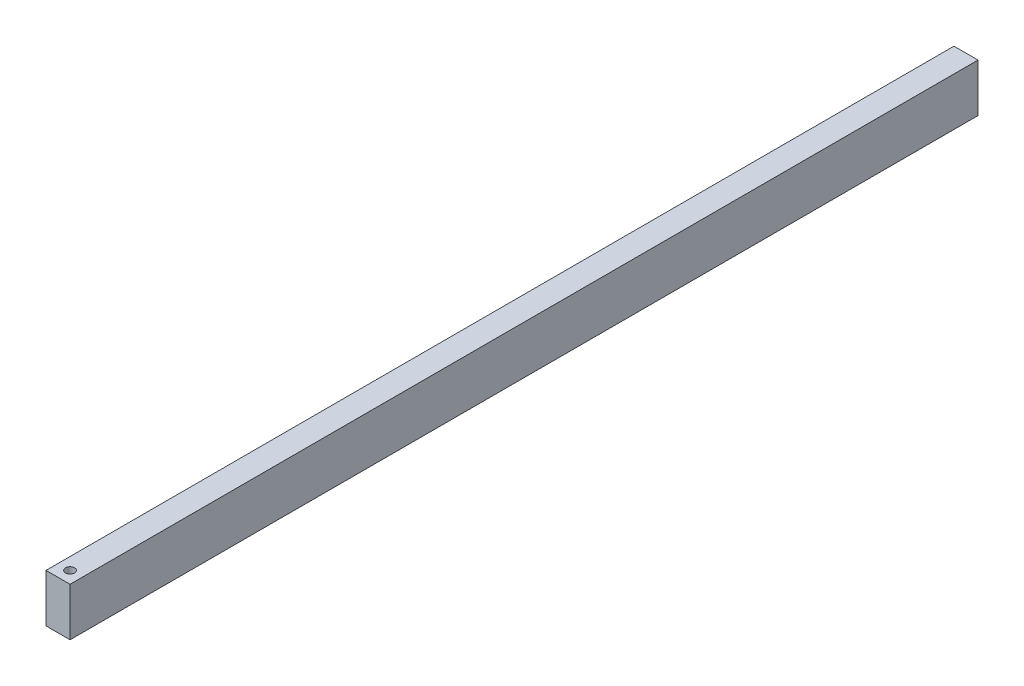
from build123d import *

# Parameters (mm, degrees)
SKETCH1_W           = 50.8
SKETCH1_H           = 101.6
BOSS_EXTRUDE1_DEPTH = 1917.7
SKETCH2_R           = 9.525
CUT_EXTRUDE1_DEPTH  = 76.2


with BuildPart() as part:
    # Sketch1 → Boss-Extrude1 (new body)
    with BuildSketch(Plane.XY):
        with Locations((25.4, 50.8)):
            Rectangle(SKETCH1_W, SKETCH1_H)
    extrude(amount=BOSS_EXTRUDE1_DEPTH)

    # Sketch2 → Cut-Extrude1 (cut)
    with BuildSketch(Plane(origin=(0, 101.6, 0), x_dir=(1, 0, 0), z_dir=(0, 1, 0))):
        with Locations(Location((25.4, -1892.3, 0), (0, 0, 270))):
            Circle(SKETCH2_R)
    extrude(amount=-CUT_EXTRUDE1_DEPTH, mode=Mode.SUBTRACT)


solid = part.part
